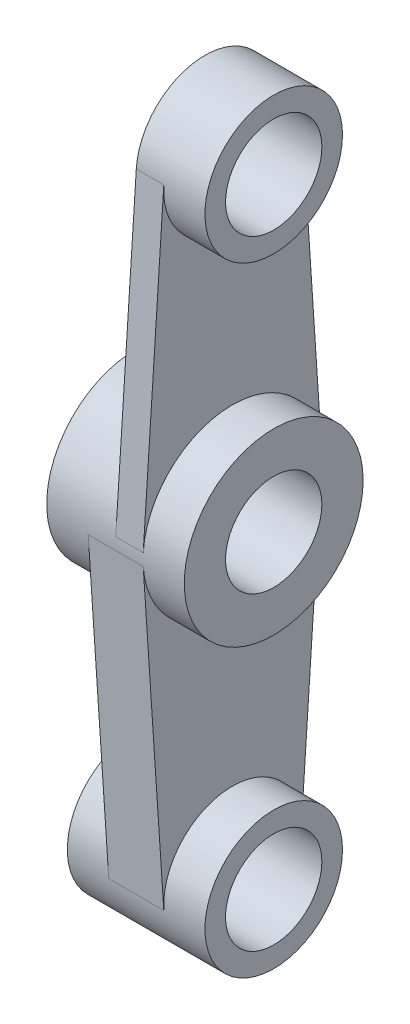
ISO-10303-21;
HEADER;
FILE_DESCRIPTION(('STEP AP214'),'2;1');
FILE_NAME('part.step','',(''),(''),'','','');
FILE_SCHEMA(('AUTOMOTIVE_DESIGN { 1 0 10303 214 1 1 1 1 }'));
ENDSEC;
DATA;
#1=APPLICATION_CONTEXT('core data for automotive mechanical design processes');
#2=APPLICATION_PROTOCOL_DEFINITION('international standard','automotive_design',2000,#1);
#3=PRODUCT_CONTEXT('',#1,'mechanical');
#4=PRODUCT('Part','Part','',(#3));
#5=PRODUCT_RELATED_PRODUCT_CATEGORY('part','',(#4));
#6=PRODUCT_DEFINITION_FORMATION('','',#4);
#7=PRODUCT_DEFINITION_CONTEXT('part definition',#1,'design');
#8=PRODUCT_DEFINITION('design','',#6,#7);
#9=PRODUCT_DEFINITION_SHAPE('','',#8);
#10=(LENGTH_UNIT() NAMED_UNIT(*) SI_UNIT(.MILLI.,.METRE.));
#11=(NAMED_UNIT(*) PLANE_ANGLE_UNIT() SI_UNIT($,.RADIAN.));
#12=(NAMED_UNIT(*) SI_UNIT($,.STERADIAN.) SOLID_ANGLE_UNIT());
#13=UNCERTAINTY_MEASURE_WITH_UNIT(LENGTH_MEASURE(1.E-05),#10,'distance_accuracy_value','');
#14=(GEOMETRIC_REPRESENTATION_CONTEXT(3) GLOBAL_UNCERTAINTY_ASSIGNED_CONTEXT((#13)) GLOBAL_UNIT_ASSIGNED_CONTEXT((#10,
#11,#12)) REPRESENTATION_CONTEXT('',''));
#15=CARTESIAN_POINT('',(0.,0.,0.));
#16=DIRECTION('',(0.,0.,1.));
#17=DIRECTION('',(1.,0.,0.));
#18=AXIS2_PLACEMENT_3D('',#15,#16,#17);
#19=CARTESIAN_POINT('',(10.,-2.16666666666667,32.4276973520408));
#20=DIRECTION('',(0.,0.0666666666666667,-0.997775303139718));
#21=DIRECTION('',(0.,0.997775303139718,0.0666666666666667));
#22=AXIS2_PLACEMENT_3D('',#19,#20,#21);
#23=PLANE('',#22);
#24=DIRECTION('',(0.,-0.997775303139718,-0.0666666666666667));
#25=VECTOR('',#24,1.);
#26=CARTESIAN_POINT('',(-10.,-2.16666666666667,32.4276973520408));
#27=LINE('',#26,#25);
#28=CARTESIAN_POINT('',(-10.,-2.16666666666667,32.4276973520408));
#29=VERTEX_POINT('',#28);
#30=CARTESIAN_POINT('',(-10.,-114.166666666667,24.9443825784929));
#31=VERTEX_POINT('',#30);
#32=EDGE_CURVE('E110',#29,#31,#27,.T.);
#33=ORIENTED_EDGE('',*,*,#32,.T.);
#34=DIRECTION('',(-1.,0.,0.));
#35=VECTOR('',#34,1.);
#36=CARTESIAN_POINT('',(10.,-114.166666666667,24.9443825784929));
#37=LINE('',#36,#35);
#38=CARTESIAN_POINT('',(10.,-114.166666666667,24.9443825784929));
#39=VERTEX_POINT('',#38);
#40=EDGE_CURVE('E44',#39,#31,#37,.T.);
#41=ORIENTED_EDGE('',*,*,#40,.F.);
#42=DIRECTION('',(0.,-0.997775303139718,-0.0666666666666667));
#43=VECTOR('',#42,1.);
#44=CARTESIAN_POINT('',(10.,-2.16666666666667,32.4276973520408));
#45=LINE('',#44,#43);
#46=CARTESIAN_POINT('',(10.,-2.16666666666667,32.4276973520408));
#47=VERTEX_POINT('',#46);
#48=EDGE_CURVE('E126',#47,#39,#45,.T.);
#49=ORIENTED_EDGE('',*,*,#48,.F.);
#50=DIRECTION('',(-1.,0.,0.));
#51=VECTOR('',#50,1.);
#52=CARTESIAN_POINT('',(10.,-2.16666666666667,32.4276973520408));
#53=LINE('',#52,#51);
#54=EDGE_CURVE('E11',#47,#29,#53,.T.);
#55=ORIENTED_EDGE('',*,*,#54,.T.);
#56=EDGE_LOOP('',(#33,#41,#49,#55));
#57=FACE_BOUND('',#56,.T.);
#58=ADVANCED_FACE('F37',(#57),#23,.F.);
#59=CARTESIAN_POINT('',(10.,-2.16666666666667,-32.4276973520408));
#60=DIRECTION('',(0.,-0.0666666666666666,-0.997775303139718));
#61=DIRECTION('',(0.,0.997775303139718,-0.0666666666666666));
#62=AXIS2_PLACEMENT_3D('',#59,#60,#61);
#63=PLANE('',#62);
#64=DIRECTION('',(0.,-0.997775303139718,0.0666666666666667));
#65=VECTOR('',#64,1.);
#66=CARTESIAN_POINT('',(-10.,-2.16666666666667,-32.4276973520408));
#67=LINE('',#66,#65);
#68=CARTESIAN_POINT('',(-10.,-2.16666666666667,-32.4276973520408));
#69=VERTEX_POINT('',#68);
#70=CARTESIAN_POINT('',(-10.,-114.166666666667,-24.944382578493));
#71=VERTEX_POINT('',#70);
#72=EDGE_CURVE('E109',#69,#71,#67,.T.);
#73=ORIENTED_EDGE('',*,*,#72,.F.);
#74=DIRECTION('',(-1.,0.,0.));
#75=VECTOR('',#74,1.);
#76=CARTESIAN_POINT('',(10.,-2.16666666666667,-32.4276973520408));
#77=LINE('',#76,#75);
#78=CARTESIAN_POINT('',(10.,-2.16666666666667,-32.4276973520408));
#79=VERTEX_POINT('',#78);
#80=EDGE_CURVE('E119',#79,#69,#77,.T.);
#81=ORIENTED_EDGE('',*,*,#80,.F.);
#82=DIRECTION('',(0.,-0.997775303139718,0.0666666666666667));
#83=VECTOR('',#82,1.);
#84=CARTESIAN_POINT('',(10.,-2.16666666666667,-32.4276973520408));
#85=LINE('',#84,#83);
#86=CARTESIAN_POINT('',(10.,-114.166666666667,-24.9443825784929));
#87=VERTEX_POINT('',#86);
#88=EDGE_CURVE('E118',#79,#87,#85,.T.);
#89=ORIENTED_EDGE('',*,*,#88,.T.);
#90=DIRECTION('',(-1.,0.,0.));
#91=VECTOR('',#90,1.);
#92=CARTESIAN_POINT('',(10.,-114.166666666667,-24.944382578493));
#93=LINE('',#92,#91);
#94=EDGE_CURVE('E102',#87,#71,#93,.T.);
#95=ORIENTED_EDGE('',*,*,#94,.T.);
#96=EDGE_LOOP('',(#73,#81,#89,#95));
#97=FACE_BOUND('',#96,.T.);
#98=ADVANCED_FACE('F115',(#97),#63,.T.);
#99=CARTESIAN_POINT('',(10.,0.,0.));
#100=DIRECTION('',(1.,0.,0.));
#101=DIRECTION('',(0.,0.,-1.));
#102=AXIS2_PLACEMENT_3D('',#99,#100,#101);
#103=PLANE('',#102);
#104=CARTESIAN_POINT('',(10.,0.,0.));
#105=DIRECTION('',(1.,0.,0.));
#106=DIRECTION('',(0.,0.,-1.));
#107=AXIS2_PLACEMENT_3D('',#104,#105,#106);
#108=CIRCLE('',#107,32.5);
#109=EDGE_CURVE('E124',#47,#79,#108,.T.);
#110=ORIENTED_EDGE('',*,*,#109,.F.);
#111=ORIENTED_EDGE('',*,*,#48,.T.);
#112=CARTESIAN_POINT('',(10.,-112.5,0.));
#113=DIRECTION('',(1.,0.,0.));
#114=DIRECTION('',(0.,0.,-1.));
#115=AXIS2_PLACEMENT_3D('',#112,#113,#114);
#116=CIRCLE('',#115,25.);
#117=EDGE_CURVE('E131',#87,#39,#116,.T.);
#118=ORIENTED_EDGE('',*,*,#117,.F.);
#119=ORIENTED_EDGE('',*,*,#88,.F.);
#120=EDGE_LOOP('',(#110,#111,#118,#119));
#121=FACE_BOUND('',#120,.T.);
#122=ADVANCED_FACE('F144',(#121),#103,.T.);
#123=CARTESIAN_POINT('',(-10.,0.,0.));
#124=DIRECTION('',(1.,0.,0.));
#125=DIRECTION('',(0.,0.,-1.));
#126=AXIS2_PLACEMENT_3D('',#123,#124,#125);
#127=PLANE('',#126);
#128=CARTESIAN_POINT('',(-10.,0.,0.));
#129=DIRECTION('',(1.,0.,0.));
#130=DIRECTION('',(0.,0.,-1.));
#131=AXIS2_PLACEMENT_3D('',#128,#129,#130);
#132=CIRCLE('',#131,32.5);
#133=EDGE_CURVE('E123',#29,#69,#132,.T.);
#134=ORIENTED_EDGE('',*,*,#133,.T.);
#135=ORIENTED_EDGE('',*,*,#72,.T.);
#136=CARTESIAN_POINT('',(-10.,-112.5,0.));
#137=DIRECTION('',(1.,0.,0.));
#138=DIRECTION('',(0.,0.,-1.));
#139=AXIS2_PLACEMENT_3D('',#136,#137,#138);
#140=CIRCLE('',#139,25.);
#141=EDGE_CURVE('E98',#71,#31,#140,.T.);
#142=ORIENTED_EDGE('',*,*,#141,.T.);
#143=ORIENTED_EDGE('',*,*,#32,.F.);
#144=EDGE_LOOP('',(#134,#135,#142,#143));
#145=FACE_BOUND('',#144,.T.);
#146=ADVANCED_FACE('F122',(#145),#127,.F.);
#147=CARTESIAN_POINT('',(25.,0.,0.));
#148=DIRECTION('',(-1.,0.,0.));
#149=DIRECTION('',(0.,0.,1.));
#150=AXIS2_PLACEMENT_3D('',#147,#148,#149);
#151=CYLINDRICAL_SURFACE('',#150,17.5);
#152=CARTESIAN_POINT('',(25.,0.,0.));
#153=DIRECTION('',(1.,0.,0.));
#154=DIRECTION('',(0.,0.,-1.));
#155=AXIS2_PLACEMENT_3D('',#152,#153,#154);
#156=CIRCLE('',#155,17.5);
#157=CARTESIAN_POINT('',(25.,0.,-17.5));
#158=VERTEX_POINT('',#157);
#159=EDGE_CURVE('E149',#158,#158,#156,.T.);
#160=ORIENTED_EDGE('',*,*,#159,.T.);
#161=EDGE_LOOP('',(#160));
#162=FACE_BOUND('',#161,.T.);
#163=CARTESIAN_POINT('',(-25.,0.,0.));
#164=DIRECTION('',(1.,0.,0.));
#165=DIRECTION('',(0.,0.,-1.));
#166=AXIS2_PLACEMENT_3D('',#163,#164,#165);
#167=CIRCLE('',#166,17.5);
#168=CARTESIAN_POINT('',(-25.,0.,-17.5));
#169=VERTEX_POINT('',#168);
#170=EDGE_CURVE('E150',#169,#169,#167,.T.);
#171=ORIENTED_EDGE('',*,*,#170,.F.);
#172=EDGE_LOOP('',(#171));
#173=FACE_BOUND('',#172,.T.);
#174=ADVANCED_FACE('F239',(#162,#173),#151,.F.);
#175=CARTESIAN_POINT('',(25.,0.,0.));
#176=DIRECTION('',(-1.,0.,0.));
#177=DIRECTION('',(0.,0.,1.));
#178=AXIS2_PLACEMENT_3D('',#175,#176,#177);
#179=CYLINDRICAL_SURFACE('',#178,32.5);
#180=DIRECTION('',(-1.,0.,0.));
#181=VECTOR('',#180,1.);
#182=CARTESIAN_POINT('',(10.,2.16666666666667,-32.4276973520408));
#183=LINE('',#182,#181);
#184=CARTESIAN_POINT('',(10.,2.16666666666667,-32.4276973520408));
#185=VERTEX_POINT('',#184);
#186=CARTESIAN_POINT('',(0.,2.16666666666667,-32.4276973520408));
#187=VERTEX_POINT('',#186);
#188=EDGE_CURVE('E51',#185,#187,#183,.T.);
#189=ORIENTED_EDGE('',*,*,#188,.F.);
#190=CARTESIAN_POINT('',(10.,0.,0.));
#191=DIRECTION('',(1.,0.,0.));
#192=DIRECTION('',(0.,0.,-1.));
#193=AXIS2_PLACEMENT_3D('',#190,#191,#192);
#194=CIRCLE('',#193,32.5);
#195=CARTESIAN_POINT('',(10.,2.16666666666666,32.4276973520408));
#196=VERTEX_POINT('',#195);
#197=EDGE_CURVE('E55',#185,#196,#194,.T.);
#198=ORIENTED_EDGE('',*,*,#197,.T.);
#199=DIRECTION('',(-1.,0.,0.));
#200=VECTOR('',#199,1.);
#201=CARTESIAN_POINT('',(10.,2.16666666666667,32.4276973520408));
#202=LINE('',#201,#200);
#203=CARTESIAN_POINT('',(0.,2.16666666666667,32.4276973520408));
#204=VERTEX_POINT('',#203);
#205=EDGE_CURVE('E164',#196,#204,#202,.T.);
#206=ORIENTED_EDGE('',*,*,#205,.T.);
#207=CARTESIAN_POINT('',(0.,0.,0.));
#208=DIRECTION('',(1.,0.,0.));
#209=DIRECTION('',(0.,0.,-1.));
#210=AXIS2_PLACEMENT_3D('',#207,#208,#209);
#211=CIRCLE('',#210,32.5);
#212=EDGE_CURVE('E173',#187,#204,#211,.T.);
#213=ORIENTED_EDGE('',*,*,#212,.F.);
#214=EDGE_LOOP('',(#189,#198,#206,#213));
#215=FACE_BOUND('',#214,.T.);
#216=ORIENTED_EDGE('',*,*,#109,.T.);
#217=ORIENTED_EDGE('',*,*,#80,.T.);
#218=ORIENTED_EDGE('',*,*,#133,.F.);
#219=ORIENTED_EDGE('',*,*,#54,.F.);
#220=EDGE_LOOP('',(#216,#217,#218,#219));
#221=FACE_BOUND('',#220,.T.);
#222=CARTESIAN_POINT('',(25.,0.,0.));
#223=DIRECTION('',(1.,0.,0.));
#224=DIRECTION('',(0.,0.,-1.));
#225=AXIS2_PLACEMENT_3D('',#222,#223,#224);
#226=CIRCLE('',#225,32.5);
#227=CARTESIAN_POINT('',(25.,0.,-32.5));
#228=VERTEX_POINT('',#227);
#229=EDGE_CURVE('E136',#228,#228,#226,.T.);
#230=ORIENTED_EDGE('',*,*,#229,.F.);
#231=EDGE_LOOP('',(#230));
#232=FACE_BOUND('',#231,.T.);
#233=CARTESIAN_POINT('',(-25.,0.,0.));
#234=DIRECTION('',(1.,0.,0.));
#235=DIRECTION('',(0.,0.,-1.));
#236=AXIS2_PLACEMENT_3D('',#233,#234,#235);
#237=CIRCLE('',#236,32.5);
#238=CARTESIAN_POINT('',(-25.,0.,-32.5));
#239=VERTEX_POINT('',#238);
#240=EDGE_CURVE('E146',#239,#239,#237,.T.);
#241=ORIENTED_EDGE('',*,*,#240,.T.);
#242=EDGE_LOOP('',(#241));
#243=FACE_BOUND('',#242,.T.);
#244=ADVANCED_FACE('F141',(#215,#221,#232,#243),#179,.T.);
#245=CARTESIAN_POINT('',(25.,0.,0.));
#246=DIRECTION('',(1.,0.,0.));
#247=DIRECTION('',(0.,0.,-1.));
#248=AXIS2_PLACEMENT_3D('',#245,#246,#247);
#249=PLANE('',#248);
#250=ORIENTED_EDGE('',*,*,#159,.F.);
#251=EDGE_LOOP('',(#250));
#252=FACE_BOUND('',#251,.T.);
#253=ORIENTED_EDGE('',*,*,#229,.T.);
#254=EDGE_LOOP('',(#253));
#255=FACE_BOUND('',#254,.T.);
#256=ADVANCED_FACE('F246',(#252,#255),#249,.T.);
#257=CARTESIAN_POINT('',(-25.,0.,0.));
#258=DIRECTION('',(1.,0.,0.));
#259=DIRECTION('',(0.,0.,-1.));
#260=AXIS2_PLACEMENT_3D('',#257,#258,#259);
#261=PLANE('',#260);
#262=ORIENTED_EDGE('',*,*,#170,.T.);
#263=EDGE_LOOP('',(#262));
#264=FACE_BOUND('',#263,.T.);
#265=ORIENTED_EDGE('',*,*,#240,.F.);
#266=EDGE_LOOP('',(#265));
#267=FACE_BOUND('',#266,.T.);
#268=ADVANCED_FACE('F247',(#264,#267),#261,.F.);
#269=CARTESIAN_POINT('',(10.,2.16666666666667,-32.4276973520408));
#270=DIRECTION('',(0.,0.0666666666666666,-0.997775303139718));
#271=DIRECTION('',(0.,0.997775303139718,0.0666666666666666));
#272=AXIS2_PLACEMENT_3D('',#269,#270,#271);
#273=PLANE('',#272);
#274=DIRECTION('',(0.,-0.997775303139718,-0.0666666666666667));
#275=VECTOR('',#274,1.);
#276=CARTESIAN_POINT('',(0.,2.16666666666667,-32.4276973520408));
#277=LINE('',#276,#275);
#278=CARTESIAN_POINT('',(0.,114.166666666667,-24.944382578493));
#279=VERTEX_POINT('',#278);
#280=EDGE_CURVE('E170',#279,#187,#277,.T.);
#281=ORIENTED_EDGE('',*,*,#280,.F.);
#282=DIRECTION('',(-1.,0.,0.));
#283=VECTOR('',#282,1.);
#284=CARTESIAN_POINT('',(10.,114.166666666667,-24.944382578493));
#285=LINE('',#284,#283);
#286=CARTESIAN_POINT('',(10.,114.166666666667,-24.944382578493));
#287=VERTEX_POINT('',#286);
#288=EDGE_CURVE('E158',#287,#279,#285,.T.);
#289=ORIENTED_EDGE('',*,*,#288,.F.);
#290=DIRECTION('',(0.,-0.997775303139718,-0.0666666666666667));
#291=VECTOR('',#290,1.);
#292=CARTESIAN_POINT('',(10.,2.16666666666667,-32.4276973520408));
#293=LINE('',#292,#291);
#294=EDGE_CURVE('E180',#287,#185,#293,.T.);
#295=ORIENTED_EDGE('',*,*,#294,.T.);
#296=ORIENTED_EDGE('',*,*,#188,.T.);
#297=EDGE_LOOP('',(#281,#289,#295,#296));
#298=FACE_BOUND('',#297,.T.);
#299=ADVANCED_FACE('F250',(#298),#273,.T.);
#300=CARTESIAN_POINT('',(10.,2.16666666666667,32.4276973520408));
#301=DIRECTION('',(0.,-0.0666666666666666,-0.997775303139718));
#302=DIRECTION('',(0.,0.997775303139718,-0.0666666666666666));
#303=AXIS2_PLACEMENT_3D('',#300,#301,#302);
#304=PLANE('',#303);
#305=DIRECTION('',(0.,-0.997775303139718,0.0666666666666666));
#306=VECTOR('',#305,1.);
#307=CARTESIAN_POINT('',(0.,2.16666666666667,32.4276973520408));
#308=LINE('',#307,#306);
#309=CARTESIAN_POINT('',(0.,114.166666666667,24.9443825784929));
#310=VERTEX_POINT('',#309);
#311=EDGE_CURVE('E167',#310,#204,#308,.T.);
#312=ORIENTED_EDGE('',*,*,#311,.T.);
#313=ORIENTED_EDGE('',*,*,#205,.F.);
#314=DIRECTION('',(0.,-0.997775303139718,0.0666666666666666));
#315=VECTOR('',#314,1.);
#316=CARTESIAN_POINT('',(10.,2.16666666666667,32.4276973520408));
#317=LINE('',#316,#315);
#318=CARTESIAN_POINT('',(10.,114.166666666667,24.9443825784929));
#319=VERTEX_POINT('',#318);
#320=EDGE_CURVE('E166',#319,#196,#317,.T.);
#321=ORIENTED_EDGE('',*,*,#320,.F.);
#322=DIRECTION('',(-1.,0.,0.));
#323=VECTOR('',#322,1.);
#324=CARTESIAN_POINT('',(10.,114.166666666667,24.944382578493));
#325=LINE('',#324,#323);
#326=EDGE_CURVE('E161',#319,#310,#325,.T.);
#327=ORIENTED_EDGE('',*,*,#326,.T.);
#328=EDGE_LOOP('',(#312,#313,#321,#327));
#329=FACE_BOUND('',#328,.T.);
#330=ADVANCED_FACE('F257',(#329),#304,.F.);
#331=CARTESIAN_POINT('',(10.,0.,0.));
#332=DIRECTION('',(1.,0.,0.));
#333=DIRECTION('',(0.,0.,-1.));
#334=AXIS2_PLACEMENT_3D('',#331,#332,#333);
#335=PLANE('',#334);
#336=ORIENTED_EDGE('',*,*,#197,.F.);
#337=ORIENTED_EDGE('',*,*,#294,.F.);
#338=CARTESIAN_POINT('',(10.,112.5,0.));
#339=DIRECTION('',(1.,0.,0.));
#340=DIRECTION('',(0.,0.,-1.));
#341=AXIS2_PLACEMENT_3D('',#338,#339,#340);
#342=CIRCLE('',#341,25.);
#343=EDGE_CURVE('E178',#319,#287,#342,.T.);
#344=ORIENTED_EDGE('',*,*,#343,.F.);
#345=ORIENTED_EDGE('',*,*,#320,.T.);
#346=EDGE_LOOP('',(#336,#337,#344,#345));
#347=FACE_BOUND('',#346,.T.);
#348=ADVANCED_FACE('F261',(#347),#335,.T.);
#349=CARTESIAN_POINT('',(0.,0.,0.));
#350=DIRECTION('',(1.,0.,0.));
#351=DIRECTION('',(0.,0.,-1.));
#352=AXIS2_PLACEMENT_3D('',#349,#350,#351);
#353=PLANE('',#352);
#354=ORIENTED_EDGE('',*,*,#212,.T.);
#355=ORIENTED_EDGE('',*,*,#311,.F.);
#356=CARTESIAN_POINT('',(0.,112.5,0.));
#357=DIRECTION('',(1.,0.,0.));
#358=DIRECTION('',(0.,0.,-1.));
#359=AXIS2_PLACEMENT_3D('',#356,#357,#358);
#360=CIRCLE('',#359,25.);
#361=EDGE_CURVE('E184',#279,#310,#360,.T.);
#362=ORIENTED_EDGE('',*,*,#361,.F.);
#363=ORIENTED_EDGE('',*,*,#280,.T.);
#364=EDGE_LOOP('',(#354,#355,#362,#363));
#365=FACE_BOUND('',#364,.T.);
#366=CARTESIAN_POINT('',(0.,112.5,0.));
#367=DIRECTION('',(1.,0.,0.));
#368=DIRECTION('',(0.,0.,-1.));
#369=AXIS2_PLACEMENT_3D('',#366,#367,#368);
#370=CIRCLE('',#369,17.5);
#371=CARTESIAN_POINT('',(0.,112.5,-17.5));
#372=VERTEX_POINT('',#371);
#373=EDGE_CURVE('E187',#372,#372,#370,.T.);
#374=ORIENTED_EDGE('',*,*,#373,.T.);
#375=EDGE_LOOP('',(#374));
#376=FACE_BOUND('',#375,.T.);
#377=ADVANCED_FACE('F263',(#365,#376),#353,.F.);
#378=CARTESIAN_POINT('',(25.,112.5,0.));
#379=DIRECTION('',(-1.,0.,0.));
#380=DIRECTION('',(0.,0.,1.));
#381=AXIS2_PLACEMENT_3D('',#378,#379,#380);
#382=CYLINDRICAL_SURFACE('',#381,17.5);
#383=CARTESIAN_POINT('',(25.,112.5,0.));
#384=DIRECTION('',(1.,0.,0.));
#385=DIRECTION('',(0.,0.,-1.));
#386=AXIS2_PLACEMENT_3D('',#383,#384,#385);
#387=CIRCLE('',#386,17.5);
#388=CARTESIAN_POINT('',(25.,112.5,-17.5));
#389=VERTEX_POINT('',#388);
#390=EDGE_CURVE('E186',#389,#389,#387,.T.);
#391=ORIENTED_EDGE('',*,*,#390,.T.);
#392=EDGE_LOOP('',(#391));
#393=FACE_BOUND('',#392,.T.);
#394=ORIENTED_EDGE('',*,*,#373,.F.);
#395=EDGE_LOOP('',(#394));
#396=FACE_BOUND('',#395,.T.);
#397=ADVANCED_FACE('F266',(#393,#396),#382,.F.);
#398=CARTESIAN_POINT('',(25.,112.5,0.));
#399=DIRECTION('',(-1.,0.,0.));
#400=DIRECTION('',(0.,0.,1.));
#401=AXIS2_PLACEMENT_3D('',#398,#399,#400);
#402=CYLINDRICAL_SURFACE('',#401,25.);
#403=ORIENTED_EDGE('',*,*,#288,.T.);
#404=ORIENTED_EDGE('',*,*,#361,.T.);
#405=ORIENTED_EDGE('',*,*,#326,.F.);
#406=ORIENTED_EDGE('',*,*,#343,.T.);
#407=EDGE_LOOP('',(#403,#404,#405,#406));
#408=FACE_BOUND('',#407,.T.);
#409=CARTESIAN_POINT('',(25.,112.5,0.));
#410=DIRECTION('',(1.,0.,0.));
#411=DIRECTION('',(0.,0.,-1.));
#412=AXIS2_PLACEMENT_3D('',#409,#410,#411);
#413=CIRCLE('',#412,25.);
#414=CARTESIAN_POINT('',(25.,112.5,-25.));
#415=VERTEX_POINT('',#414);
#416=EDGE_CURVE('E176',#415,#415,#413,.T.);
#417=ORIENTED_EDGE('',*,*,#416,.F.);
#418=EDGE_LOOP('',(#417));
#419=FACE_BOUND('',#418,.T.);
#420=ADVANCED_FACE('F273',(#408,#419),#402,.T.);
#421=CARTESIAN_POINT('',(25.,0.,0.));
#422=DIRECTION('',(1.,0.,0.));
#423=DIRECTION('',(0.,0.,-1.));
#424=AXIS2_PLACEMENT_3D('',#421,#422,#423);
#425=PLANE('',#424);
#426=ORIENTED_EDGE('',*,*,#390,.F.);
#427=EDGE_LOOP('',(#426));
#428=FACE_BOUND('',#427,.T.);
#429=ORIENTED_EDGE('',*,*,#416,.T.);
#430=EDGE_LOOP('',(#429));
#431=FACE_BOUND('',#430,.T.);
#432=ADVANCED_FACE('F212',(#428,#431),#425,.T.);
#433=CARTESIAN_POINT('',(25.,-112.5,0.));
#434=DIRECTION('',(-1.,0.,0.));
#435=DIRECTION('',(0.,0.,1.));
#436=AXIS2_PLACEMENT_3D('',#433,#434,#435);
#437=CYLINDRICAL_SURFACE('',#436,25.);
#438=ORIENTED_EDGE('',*,*,#117,.T.);
#439=ORIENTED_EDGE('',*,*,#40,.T.);
#440=ORIENTED_EDGE('',*,*,#141,.F.);
#441=ORIENTED_EDGE('',*,*,#94,.F.);
#442=EDGE_LOOP('',(#438,#439,#440,#441));
#443=FACE_BOUND('',#442,.T.);
#444=CARTESIAN_POINT('',(25.,-112.5,0.));
#445=DIRECTION('',(1.,0.,0.));
#446=DIRECTION('',(0.,0.,-1.));
#447=AXIS2_PLACEMENT_3D('',#444,#445,#446);
#448=CIRCLE('',#447,25.);
#449=CARTESIAN_POINT('',(25.,-112.5,-25.));
#450=VERTEX_POINT('',#449);
#451=EDGE_CURVE('E198',#450,#450,#448,.T.);
#452=ORIENTED_EDGE('',*,*,#451,.F.);
#453=EDGE_LOOP('',(#452));
#454=FACE_BOUND('',#453,.T.);
#455=CARTESIAN_POINT('',(-25.,-112.5,0.));
#456=DIRECTION('',(1.,0.,0.));
#457=DIRECTION('',(0.,0.,-1.));
#458=AXIS2_PLACEMENT_3D('',#455,#456,#457);
#459=CIRCLE('',#458,25.);
#460=CARTESIAN_POINT('',(-25.,-112.5,-25.));
#461=VERTEX_POINT('',#460);
#462=EDGE_CURVE('E199',#461,#461,#459,.T.);
#463=ORIENTED_EDGE('',*,*,#462,.T.);
#464=EDGE_LOOP('',(#463));
#465=FACE_BOUND('',#464,.T.);
#466=ADVANCED_FACE('F100',(#443,#454,#465),#437,.T.);
#467=CARTESIAN_POINT('',(25.,-112.5,0.));
#468=DIRECTION('',(-1.,0.,0.));
#469=DIRECTION('',(0.,0.,1.));
#470=AXIS2_PLACEMENT_3D('',#467,#468,#469);
#471=CYLINDRICAL_SURFACE('',#470,17.5);
#472=CARTESIAN_POINT('',(25.,-112.5,0.));
#473=DIRECTION('',(1.,0.,0.));
#474=DIRECTION('',(0.,0.,-1.));
#475=AXIS2_PLACEMENT_3D('',#472,#473,#474);
#476=CIRCLE('',#475,17.5);
#477=CARTESIAN_POINT('',(25.,-112.5,-17.5));
#478=VERTEX_POINT('',#477);
#479=EDGE_CURVE('E190',#478,#478,#476,.T.);
#480=ORIENTED_EDGE('',*,*,#479,.T.);
#481=EDGE_LOOP('',(#480));
#482=FACE_BOUND('',#481,.T.);
#483=CARTESIAN_POINT('',(-25.,-112.5,0.));
#484=DIRECTION('',(1.,0.,0.));
#485=DIRECTION('',(0.,0.,-1.));
#486=AXIS2_PLACEMENT_3D('',#483,#484,#485);
#487=CIRCLE('',#486,17.5);
#488=CARTESIAN_POINT('',(-25.,-112.5,-17.5));
#489=VERTEX_POINT('',#488);
#490=EDGE_CURVE('E195',#489,#489,#487,.T.);
#491=ORIENTED_EDGE('',*,*,#490,.F.);
#492=EDGE_LOOP('',(#491));
#493=FACE_BOUND('',#492,.T.);
#494=ADVANCED_FACE('F211',(#482,#493),#471,.F.);
#495=CARTESIAN_POINT('',(25.,0.,0.));
#496=DIRECTION('',(1.,0.,0.));
#497=DIRECTION('',(0.,0.,-1.));
#498=AXIS2_PLACEMENT_3D('',#495,#496,#497);
#499=PLANE('',#498);
#500=ORIENTED_EDGE('',*,*,#451,.T.);
#501=EDGE_LOOP('',(#500));
#502=FACE_BOUND('',#501,.T.);
#503=ORIENTED_EDGE('',*,*,#479,.F.);
#504=EDGE_LOOP('',(#503));
#505=FACE_BOUND('',#504,.T.);
#506=ADVANCED_FACE('F207',(#502,#505),#499,.T.);
#507=CARTESIAN_POINT('',(-25.,0.,0.));
#508=DIRECTION('',(1.,0.,0.));
#509=DIRECTION('',(0.,0.,-1.));
#510=AXIS2_PLACEMENT_3D('',#507,#508,#509);
#511=PLANE('',#510);
#512=ORIENTED_EDGE('',*,*,#462,.F.);
#513=EDGE_LOOP('',(#512));
#514=FACE_BOUND('',#513,.T.);
#515=ORIENTED_EDGE('',*,*,#490,.T.);
#516=EDGE_LOOP('',(#515));
#517=FACE_BOUND('',#516,.T.);
#518=ADVANCED_FACE('F216',(#514,#517),#511,.F.);
#519=CLOSED_SHELL('',(#58,#98,#122,#146,#174,#244,#256,#268,#299,#330,#348,#377,#397,#420,#432,
#466,#494,#506,#518));
#520=MANIFOLD_SOLID_BREP('B2',#519);
#521=ADVANCED_BREP_SHAPE_REPRESENTATION('',(#18,#520),#14);
#522=SHAPE_DEFINITION_REPRESENTATION(#9,#521);
ENDSEC;
END-ISO-10303-21;
